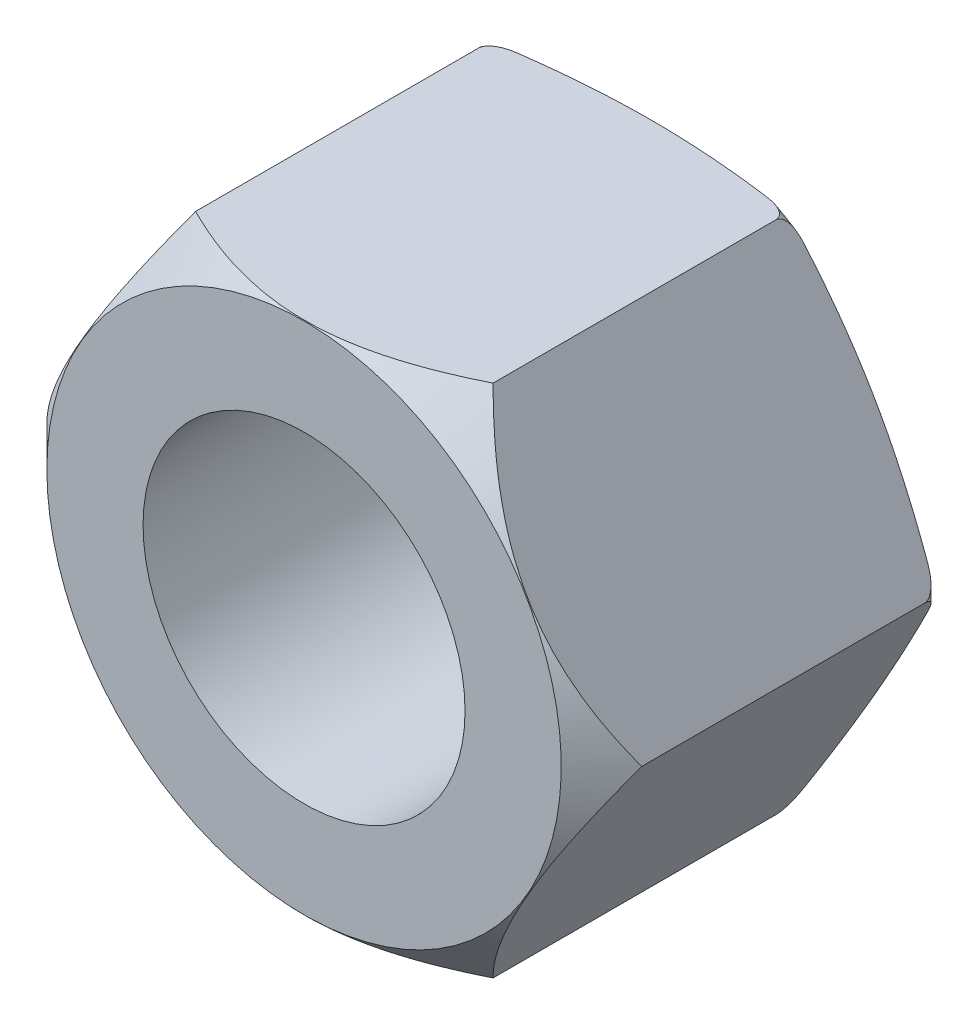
from build123d import *

# Parameters (mm, degrees)
BOSS_EXTRU_1_DEPTH      = 12.4
ESQUISSE2_R             = 5
ENL_V_MAT_EXTRU_1_DEPTH = 18.409575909


with BuildPart() as part:
    # Esquisse1 → Boss.-Extru.1 (new body)
    with BuildSketch(Plane.XY):
        Polygon((9.237604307, 0), (4.618802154, 8), (-4.618802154, 8), (-9.237604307, 0), (-4.618802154, -8), (4.618802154, -8), align=None)
    extrude(amount=BOSS_EXTRU_1_DEPTH)

    # Esquisse2 → Enl_v. mat.-Extru.1 (cut, through all)
    with BuildSketch(Plane.XY.offset(12.4)):
        Circle(ESQUISSE2_R)
    extrude(amount=-ENL_V_MAT_EXTRU_1_DEPTH, mode=Mode.SUBTRACT)

    # Esquisse4 → Enl_vement de mati_re-R_volution3 (revolve, cut)
    with BuildSketch(Plane(origin=(0, 0, 0), x_dir=(1, 0, 0), z_dir=(0, 1, 0))):
        with BuildLine():
            Line((-5.931669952, -0.726679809), (-5.844683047, -0.378732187))
            ThreePointArc((-5.844683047, -0.378732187), (-5.667317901, -0.105897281), (-5.359611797, 0))
            Line((-5.359611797, 0), (-5, 0))
            Line((-5, 0), (-5, 0.779579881))
            Line((-5, 0.779579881), (-9.859228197, 0.779579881))
            Line((-9.859228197, 0.779579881), (-9.859228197, -2.985877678))
            Line((-9.859228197, -2.985877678), (-9.237604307, -2.985877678))
            Line((-9.237604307, -2.985877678), (-9.237604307, -2.368871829))
            ThreePointArc((-9.237604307, -2.368871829), (-9.139958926, -2.072037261), (-8.885161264, -1.891140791))
            Line((-8.885161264, -1.891140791), (-6.269184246, -1.083143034))
            ThreePointArc((-6.269184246, -1.083143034), (-6.053669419, -0.949183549), (-5.931669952, -0.726679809))
        make_face()
        Polygon((-9.859228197, -13.304488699), (-7.987604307, -13.304488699), (-7.987604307, -12.4), (-9.237604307, -11.15), (-9.859228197, -11.15), align=None)
    revolve(axis=Axis((0, 0, -0.399579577), (0, 0, 1)), mode=Mode.SUBTRACT)


solid = part.part
